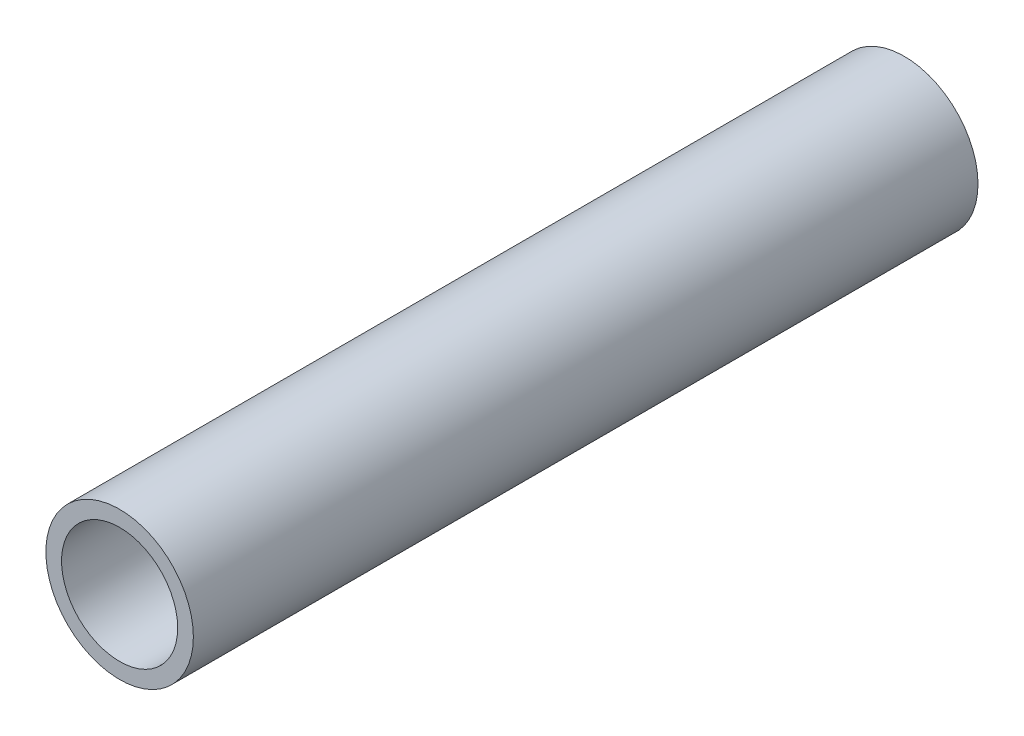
from build123d import *

# Parameters (mm, degrees)
PIPESKETCH_R   = 1.1938
PIPESKETCH_R_2 = 0.9398


with BuildPart() as part:
    # ThinSweep: sweep along a curve in space
    with BuildLine() as thinsweep_path:
        Line((0, 0, 0), (0, 0, 12.7))
    # PipeSketch → ThinSweep (sweep)
    with BuildSketch(Plane.XY):
        Circle(PIPESKETCH_R)
        Circle(PIPESKETCH_R_2, mode=Mode.SUBTRACT)
    sweep(path=thinsweep_path.line)


solid = part.part
